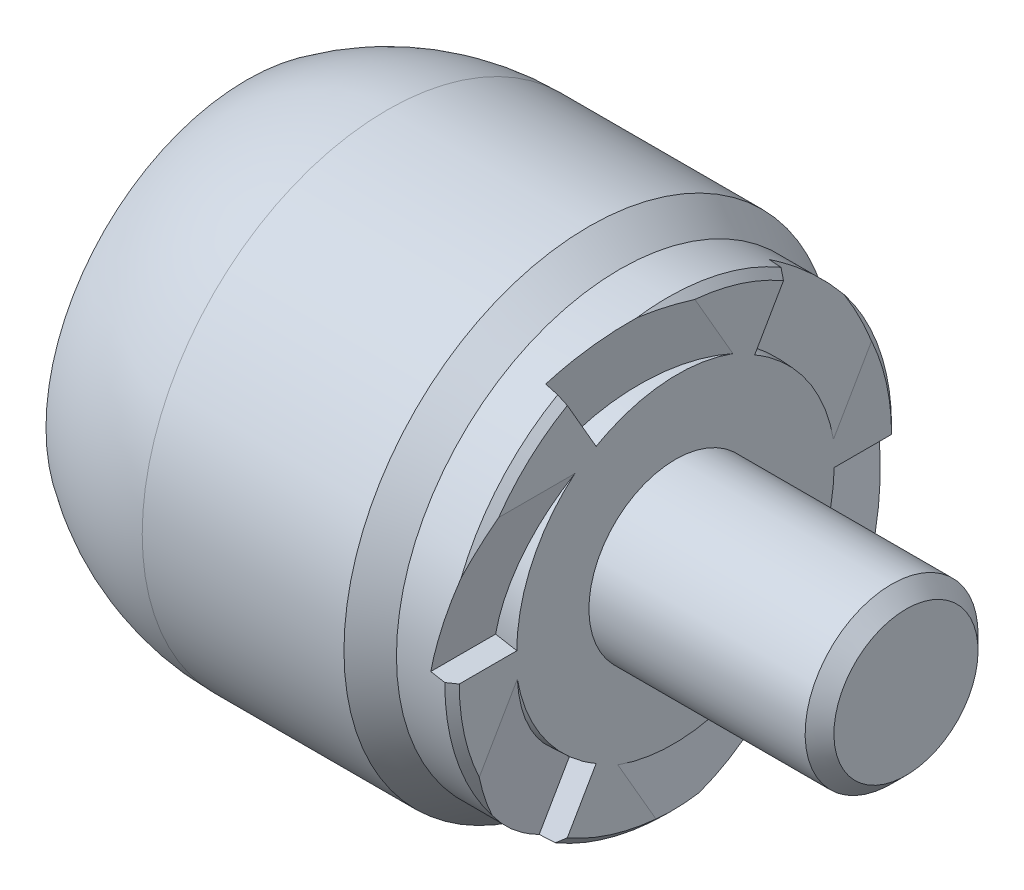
from build123d import *

# Parameters (mm, degrees)
ENL_V_MAT_EXTRU_1_DEPTH      = 1.5
R_P_TITION_CIRCULAIRE1_COUNT = 6


with BuildPart() as part:
    # Esquisse1 → Base-R_volution (revolve)
    with BuildSketch(Plane.XY):
        with BuildLine():
            Line((0, 17), (14, 17))
            Line((14, 17), (16.14222201, 15.5))
            Line((16.14222201, 15.5), (19.5, 15.5))
            Line((19.5, 15.5), (20, 15))
            Line((20, 15), (20, 6))
            Line((20, 6), (35, 6))
            Line((35, 6), (36, 5))
            Line((36, 5), (36, 0))
            Line((36, 0), (16, 0))
            Line((16, 0), (11.958548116, 7))
            Line((11.958548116, 7), (9.746794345, 7))
            ThreePointArc((9.746794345, 7), (2.013063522, 11.829944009), (-6.882917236, 9.829824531))
            Line((-6.882917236, 9.829824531), (-9.750799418, 13.925584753))
            ThreePointArc((-9.750799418, 13.925584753), (-5.111998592, 16.213188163), (0, 17))
        make_face()
    revolve(axis=Axis((94.383348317, 0, 0), (-1, 0, 0)))

    # Esquisse3 → Enl_v. mat.-Extru.1 (cut)
    with BuildSketch(Plane(origin=(19.396926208, -3.420201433, 0), x_dir=(0, 0, -1), z_dir=(0.9848077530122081, -0.1736481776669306, 0))):
        with BuildLine():
            Line((-11, 3.472963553), (-18.209947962, 3.472963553))
            ThreePointArc((-18.209947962, 3.472963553), (-15.606207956, 12.856378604), (-8.539576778, 19.556428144))
            Line((-8.539576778, 19.556428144), (-5.158463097, 13.188428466))
            ThreePointArc((-5.158463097, 13.188428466), (-9.42717068, 9.141160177), (-11, 3.472963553))
        make_face()
    enl_v_mat_extru_1 = extrude(amount=-ENL_V_MAT_EXTRU_1_DEPTH, mode=Mode.SUBTRACT)

    # R_p_tition circulaire1: Enl_v. mat.-Extru.1 ×6 about axis
    r_p_tition_circulaire1_axis = Axis((94.383348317, 0, 0), (-1, 0, 0))
    for i in range(1, R_P_TITION_CIRCULAIRE1_COUNT):
        add(enl_v_mat_extru_1.rotate(r_p_tition_circulaire1_axis, i * 360 / R_P_TITION_CIRCULAIRE1_COUNT), mode=Mode.SUBTRACT)


solid = part.part
